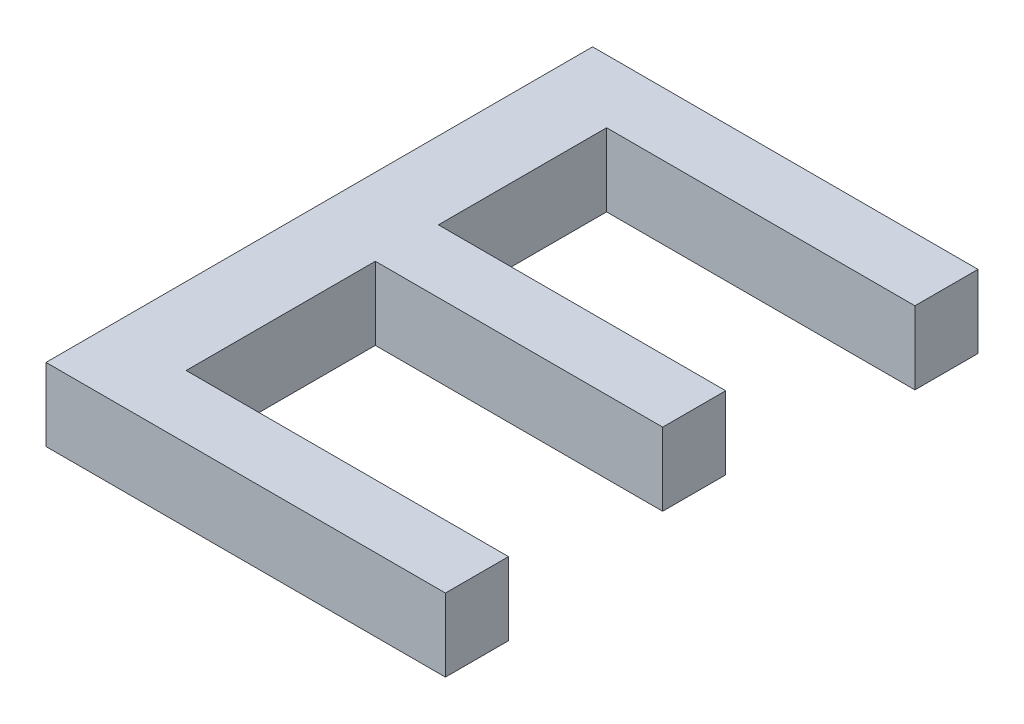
ISO-10303-21;
HEADER;
FILE_DESCRIPTION(('STEP AP214'),'2;1');
FILE_NAME('part.step','',(''),(''),'','','');
FILE_SCHEMA(('AUTOMOTIVE_DESIGN { 1 0 10303 214 1 1 1 1 }'));
ENDSEC;
DATA;
#1=APPLICATION_CONTEXT('core data for automotive mechanical design processes');
#2=APPLICATION_PROTOCOL_DEFINITION('international standard','automotive_design',2000,#1);
#3=PRODUCT_CONTEXT('',#1,'mechanical');
#4=PRODUCT('Part','Part','',(#3));
#5=PRODUCT_RELATED_PRODUCT_CATEGORY('part','',(#4));
#6=PRODUCT_DEFINITION_FORMATION('','',#4);
#7=PRODUCT_DEFINITION_CONTEXT('part definition',#1,'design');
#8=PRODUCT_DEFINITION('design','',#6,#7);
#9=PRODUCT_DEFINITION_SHAPE('','',#8);
#10=(LENGTH_UNIT() NAMED_UNIT(*) SI_UNIT(.MILLI.,.METRE.));
#11=(NAMED_UNIT(*) PLANE_ANGLE_UNIT() SI_UNIT($,.RADIAN.));
#12=(NAMED_UNIT(*) SI_UNIT($,.STERADIAN.) SOLID_ANGLE_UNIT());
#13=UNCERTAINTY_MEASURE_WITH_UNIT(LENGTH_MEASURE(1.E-05),#10,'distance_accuracy_value','');
#14=(GEOMETRIC_REPRESENTATION_CONTEXT(3) GLOBAL_UNCERTAINTY_ASSIGNED_CONTEXT((#13)) GLOBAL_UNIT_ASSIGNED_CONTEXT((#10,
#11,#12)) REPRESENTATION_CONTEXT('',''));
#15=CARTESIAN_POINT('',(0.,0.,0.));
#16=DIRECTION('',(0.,0.,1.));
#17=DIRECTION('',(1.,0.,0.));
#18=AXIS2_PLACEMENT_3D('',#15,#16,#17);
#19=CARTESIAN_POINT('',(0.,6.40004762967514,0.));
#20=DIRECTION('',(0.,-1.,0.));
#21=DIRECTION('',(-1.,0.,0.));
#22=AXIS2_PLACEMENT_3D('',#19,#20,#21);
#23=PLANE('',#22);
#24=DIRECTION('',(-1.,0.,0.));
#25=VECTOR('',#24,1.);
#26=CARTESIAN_POINT('',(0.,6.40004762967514,-8.93024100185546));
#27=LINE('',#26,#25);
#28=CARTESIAN_POINT('',(5.75738303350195,6.40004762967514,-8.93024100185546));
#29=VERTEX_POINT('',#28);
#30=CARTESIAN_POINT('',(4.6612291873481,6.40004762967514,-8.93024100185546));
#31=VERTEX_POINT('',#30);
#32=EDGE_CURVE('E170',#29,#31,#27,.T.);
#33=ORIENTED_EDGE('',*,*,#32,.T.);
#34=DIRECTION('',(0.,0.,-1.));
#35=VECTOR('',#34,1.);
#36=CARTESIAN_POINT('',(4.6612291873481,6.40004762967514,0.));
#37=LINE('',#36,#35);
#38=CARTESIAN_POINT('',(4.6612291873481,6.40004762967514,-10.4302410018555));
#39=VERTEX_POINT('',#38);
#40=EDGE_CURVE('E24',#31,#39,#37,.T.);
#41=ORIENTED_EDGE('',*,*,#40,.T.);
#42=DIRECTION('',(1.,0.,0.));
#43=VECTOR('',#42,1.);
#44=CARTESIAN_POINT('',(0.,6.40004762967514,-10.4302410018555));
#45=LINE('',#44,#43);
#46=CARTESIAN_POINT('',(5.71892149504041,6.40004762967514,-10.4302410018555));
#47=VERTEX_POINT('',#46);
#48=EDGE_CURVE('E231',#39,#47,#45,.T.);
#49=ORIENTED_EDGE('',*,*,#48,.T.);
#50=DIRECTION('',(0.,0.,1.));
#51=VECTOR('',#50,1.);
#52=CARTESIAN_POINT('',(5.71892149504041,6.40004762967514,0.));
#53=LINE('',#52,#51);
#54=CARTESIAN_POINT('',(5.71892149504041,6.40004762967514,-10.2571640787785));
#55=VERTEX_POINT('',#54);
#56=EDGE_CURVE('E240',#47,#55,#53,.T.);
#57=ORIENTED_EDGE('',*,*,#56,.T.);
#58=DIRECTION('',(-1.,0.,0.));
#59=VECTOR('',#58,1.);
#60=CARTESIAN_POINT('',(0.,6.40004762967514,-10.2571640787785));
#61=LINE('',#60,#59);
#62=CARTESIAN_POINT('',(4.87276764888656,6.40004762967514,-10.2571640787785));
#63=VERTEX_POINT('',#62);
#64=EDGE_CURVE('E247',#55,#63,#61,.T.);
#65=ORIENTED_EDGE('',*,*,#64,.T.);
#66=DIRECTION('',(0.,0.,1.));
#67=VECTOR('',#66,1.);
#68=CARTESIAN_POINT('',(4.87276764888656,6.40004762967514,0.));
#69=LINE('',#68,#67);
#70=CARTESIAN_POINT('',(4.87276764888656,6.40004762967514,-9.79562561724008));
#71=VERTEX_POINT('',#70);
#72=EDGE_CURVE('E193',#63,#71,#69,.T.);
#73=ORIENTED_EDGE('',*,*,#72,.T.);
#74=DIRECTION('',(1.,0.,0.));
#75=VECTOR('',#74,1.);
#76=CARTESIAN_POINT('',(0.,6.40004762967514,-9.79562561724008));
#77=LINE('',#76,#75);
#78=CARTESIAN_POINT('',(5.6612291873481,6.40004762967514,-9.79562561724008));
#79=VERTEX_POINT('',#78);
#80=EDGE_CURVE('E224',#71,#79,#77,.T.);
#81=ORIENTED_EDGE('',*,*,#80,.T.);
#82=DIRECTION('',(0.,0.,1.));
#83=VECTOR('',#82,1.);
#84=CARTESIAN_POINT('',(5.6612291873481,6.40004762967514,0.));
#85=LINE('',#84,#83);
#86=CARTESIAN_POINT('',(5.6612291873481,6.40004762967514,-9.62254869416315));
#87=VERTEX_POINT('',#86);
#88=EDGE_CURVE('E144',#79,#87,#85,.T.);
#89=ORIENTED_EDGE('',*,*,#88,.T.);
#90=DIRECTION('',(-1.,0.,0.));
#91=VECTOR('',#90,1.);
#92=CARTESIAN_POINT('',(0.,6.40004762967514,-9.62254869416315));
#93=LINE('',#92,#91);
#94=CARTESIAN_POINT('',(4.87276764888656,6.40004762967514,-9.62254869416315));
#95=VERTEX_POINT('',#94);
#96=EDGE_CURVE('E156',#87,#95,#93,.T.);
#97=ORIENTED_EDGE('',*,*,#96,.T.);
#98=DIRECTION('',(0.,0.,1.));
#99=VECTOR('',#98,1.);
#100=CARTESIAN_POINT('',(4.87276764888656,6.40004762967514,0.));
#101=LINE('',#100,#99);
#102=CARTESIAN_POINT('',(4.87276764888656,6.40004762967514,-9.10331792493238));
#103=VERTEX_POINT('',#102);
#104=EDGE_CURVE('E159',#95,#103,#101,.T.);
#105=ORIENTED_EDGE('',*,*,#104,.T.);
#106=DIRECTION('',(1.,0.,0.));
#107=VECTOR('',#106,1.);
#108=CARTESIAN_POINT('',(0.,6.40004762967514,-9.10331792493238));
#109=LINE('',#108,#107);
#110=CARTESIAN_POINT('',(5.75738303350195,6.40004762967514,-9.10331792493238));
#111=VERTEX_POINT('',#110);
#112=EDGE_CURVE('E207',#103,#111,#109,.T.);
#113=ORIENTED_EDGE('',*,*,#112,.T.);
#114=DIRECTION('',(0.,0.,1.));
#115=VECTOR('',#114,1.);
#116=CARTESIAN_POINT('',(5.75738303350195,6.40004762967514,0.));
#117=LINE('',#116,#115);
#118=EDGE_CURVE('E197',#111,#29,#117,.T.);
#119=ORIENTED_EDGE('',*,*,#118,.T.);
#120=EDGE_LOOP('',(#33,#41,#49,#57,#65,#73,#81,#89,#97,#105,#113,#119));
#121=FACE_BOUND('',#120,.T.);
#122=ADVANCED_FACE('F16',(#121),#23,.T.);
#123=CARTESIAN_POINT('',(0.,6.60004762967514,0.));
#124=DIRECTION('',(0.,-1.,0.));
#125=DIRECTION('',(-1.,0.,0.));
#126=AXIS2_PLACEMENT_3D('',#123,#124,#125);
#127=PLANE('',#126);
#128=DIRECTION('',(-1.,0.,0.));
#129=VECTOR('',#128,1.);
#130=CARTESIAN_POINT('',(0.,6.60004762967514,-8.93024100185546));
#131=LINE('',#130,#129);
#132=CARTESIAN_POINT('',(5.75738303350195,6.60004762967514,-8.93024100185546));
#133=VERTEX_POINT('',#132);
#134=CARTESIAN_POINT('',(4.6612291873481,6.60004762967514,-8.93024100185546));
#135=VERTEX_POINT('',#134);
#136=EDGE_CURVE('E176',#133,#135,#131,.T.);
#137=ORIENTED_EDGE('',*,*,#136,.F.);
#138=DIRECTION('',(0.,0.,1.));
#139=VECTOR('',#138,1.);
#140=CARTESIAN_POINT('',(5.75738303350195,6.60004762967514,0.));
#141=LINE('',#140,#139);
#142=CARTESIAN_POINT('',(5.75738303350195,6.60004762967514,-9.10331792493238));
#143=VERTEX_POINT('',#142);
#144=EDGE_CURVE('E204',#143,#133,#141,.T.);
#145=ORIENTED_EDGE('',*,*,#144,.F.);
#146=DIRECTION('',(1.,0.,0.));
#147=VECTOR('',#146,1.);
#148=CARTESIAN_POINT('',(0.,6.60004762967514,-9.10331792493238));
#149=LINE('',#148,#147);
#150=CARTESIAN_POINT('',(4.87276764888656,6.60004762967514,-9.10331792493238));
#151=VERTEX_POINT('',#150);
#152=EDGE_CURVE('E151',#151,#143,#149,.T.);
#153=ORIENTED_EDGE('',*,*,#152,.F.);
#154=DIRECTION('',(0.,0.,1.));
#155=VECTOR('',#154,1.);
#156=CARTESIAN_POINT('',(4.87276764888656,6.60004762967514,0.));
#157=LINE('',#156,#155);
#158=CARTESIAN_POINT('',(4.87276764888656,6.60004762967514,-9.62254869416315));
#159=VERTEX_POINT('',#158);
#160=EDGE_CURVE('E147',#159,#151,#157,.T.);
#161=ORIENTED_EDGE('',*,*,#160,.F.);
#162=DIRECTION('',(-1.,0.,0.));
#163=VECTOR('',#162,1.);
#164=CARTESIAN_POINT('',(0.,6.60004762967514,-9.62254869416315));
#165=LINE('',#164,#163);
#166=CARTESIAN_POINT('',(5.6612291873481,6.60004762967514,-9.62254869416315));
#167=VERTEX_POINT('',#166);
#168=EDGE_CURVE('E132',#167,#159,#165,.T.);
#169=ORIENTED_EDGE('',*,*,#168,.F.);
#170=DIRECTION('',(0.,0.,1.));
#171=VECTOR('',#170,1.);
#172=CARTESIAN_POINT('',(5.6612291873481,6.60004762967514,0.));
#173=LINE('',#172,#171);
#174=CARTESIAN_POINT('',(5.6612291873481,6.60004762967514,-9.79562561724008));
#175=VERTEX_POINT('',#174);
#176=EDGE_CURVE('E221',#175,#167,#173,.T.);
#177=ORIENTED_EDGE('',*,*,#176,.F.);
#178=DIRECTION('',(1.,0.,0.));
#179=VECTOR('',#178,1.);
#180=CARTESIAN_POINT('',(0.,6.60004762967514,-9.79562561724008));
#181=LINE('',#180,#179);
#182=CARTESIAN_POINT('',(4.87276764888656,6.60004762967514,-9.79562561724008));
#183=VERTEX_POINT('',#182);
#184=EDGE_CURVE('E236',#183,#175,#181,.T.);
#185=ORIENTED_EDGE('',*,*,#184,.F.);
#186=DIRECTION('',(0.,0.,1.));
#187=VECTOR('',#186,1.);
#188=CARTESIAN_POINT('',(4.87276764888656,6.60004762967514,0.));
#189=LINE('',#188,#187);
#190=CARTESIAN_POINT('',(4.87276764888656,6.60004762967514,-10.2571640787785));
#191=VERTEX_POINT('',#190);
#192=EDGE_CURVE('E192',#191,#183,#189,.T.);
#193=ORIENTED_EDGE('',*,*,#192,.F.);
#194=DIRECTION('',(-1.,0.,0.));
#195=VECTOR('',#194,1.);
#196=CARTESIAN_POINT('',(0.,6.60004762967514,-10.2571640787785));
#197=LINE('',#196,#195);
#198=CARTESIAN_POINT('',(5.71892149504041,6.60004762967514,-10.2571640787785));
#199=VERTEX_POINT('',#198);
#200=EDGE_CURVE('E250',#199,#191,#197,.T.);
#201=ORIENTED_EDGE('',*,*,#200,.F.);
#202=DIRECTION('',(0.,0.,1.));
#203=VECTOR('',#202,1.);
#204=CARTESIAN_POINT('',(5.71892149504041,6.60004762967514,0.));
#205=LINE('',#204,#203);
#206=CARTESIAN_POINT('',(5.71892149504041,6.60004762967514,-10.4302410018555));
#207=VERTEX_POINT('',#206);
#208=EDGE_CURVE('E228',#207,#199,#205,.T.);
#209=ORIENTED_EDGE('',*,*,#208,.F.);
#210=DIRECTION('',(1.,0.,0.));
#211=VECTOR('',#210,1.);
#212=CARTESIAN_POINT('',(0.,6.60004762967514,-10.4302410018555));
#213=LINE('',#212,#211);
#214=CARTESIAN_POINT('',(4.6612291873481,6.60004762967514,-10.4302410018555));
#215=VERTEX_POINT('',#214);
#216=EDGE_CURVE('E185',#215,#207,#213,.T.);
#217=ORIENTED_EDGE('',*,*,#216,.F.);
#218=DIRECTION('',(0.,0.,-1.));
#219=VECTOR('',#218,1.);
#220=CARTESIAN_POINT('',(4.6612291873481,6.60004762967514,0.));
#221=LINE('',#220,#219);
#222=EDGE_CURVE('E11',#135,#215,#221,.T.);
#223=ORIENTED_EDGE('',*,*,#222,.F.);
#224=EDGE_LOOP('',(#137,#145,#153,#161,#169,#177,#185,#193,#201,#209,#217,#223));
#225=FACE_BOUND('',#224,.T.);
#226=ADVANCED_FACE('F149',(#225),#127,.F.);
#227=CARTESIAN_POINT('',(4.6612291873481,6.60004762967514,0.));
#228=DIRECTION('',(-1.,0.,0.));
#229=DIRECTION('',(0.,0.,1.));
#230=AXIS2_PLACEMENT_3D('',#227,#228,#229);
#231=PLANE('',#230);
#232=ORIENTED_EDGE('',*,*,#40,.F.);
#233=DIRECTION('',(0.,-1.,0.));
#234=VECTOR('',#233,1.);
#235=CARTESIAN_POINT('',(4.6612291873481,6.60004762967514,-8.93024100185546));
#236=LINE('',#235,#234);
#237=EDGE_CURVE('E182',#135,#31,#236,.T.);
#238=ORIENTED_EDGE('',*,*,#237,.F.);
#239=ORIENTED_EDGE('',*,*,#222,.T.);
#240=DIRECTION('',(0.,-1.,0.));
#241=VECTOR('',#240,1.);
#242=CARTESIAN_POINT('',(4.6612291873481,6.60004762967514,-10.4302410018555));
#243=LINE('',#242,#241);
#244=EDGE_CURVE('E257',#215,#39,#243,.T.);
#245=ORIENTED_EDGE('',*,*,#244,.T.);
#246=EDGE_LOOP('',(#232,#238,#239,#245));
#247=FACE_BOUND('',#246,.T.);
#248=ADVANCED_FACE('F304',(#247),#231,.T.);
#249=CARTESIAN_POINT('',(0.,6.60004762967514,-10.4302410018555));
#250=DIRECTION('',(0.,0.,-1.));
#251=DIRECTION('',(0.,-1.,0.));
#252=AXIS2_PLACEMENT_3D('',#249,#250,#251);
#253=PLANE('',#252);
#254=ORIENTED_EDGE('',*,*,#48,.F.);
#255=ORIENTED_EDGE('',*,*,#244,.F.);
#256=ORIENTED_EDGE('',*,*,#216,.T.);
#257=DIRECTION('',(0.,-1.,0.));
#258=VECTOR('',#257,1.);
#259=CARTESIAN_POINT('',(5.71892149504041,6.60004762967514,-10.4302410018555));
#260=LINE('',#259,#258);
#261=EDGE_CURVE('E232',#207,#47,#260,.T.);
#262=ORIENTED_EDGE('',*,*,#261,.T.);
#263=EDGE_LOOP('',(#254,#255,#256,#262));
#264=FACE_BOUND('',#263,.T.);
#265=ADVANCED_FACE('F265',(#264),#253,.T.);
#266=CARTESIAN_POINT('',(5.71892149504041,6.60004762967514,0.));
#267=DIRECTION('',(1.,0.,0.));
#268=DIRECTION('',(0.,-1.,0.));
#269=AXIS2_PLACEMENT_3D('',#266,#267,#268);
#270=PLANE('',#269);
#271=ORIENTED_EDGE('',*,*,#56,.F.);
#272=ORIENTED_EDGE('',*,*,#261,.F.);
#273=ORIENTED_EDGE('',*,*,#208,.T.);
#274=DIRECTION('',(0.,-1.,0.));
#275=VECTOR('',#274,1.);
#276=CARTESIAN_POINT('',(5.71892149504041,6.60004762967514,-10.2571640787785));
#277=LINE('',#276,#275);
#278=EDGE_CURVE('E169',#199,#55,#277,.T.);
#279=ORIENTED_EDGE('',*,*,#278,.T.);
#280=EDGE_LOOP('',(#271,#272,#273,#279));
#281=FACE_BOUND('',#280,.T.);
#282=ADVANCED_FACE('F273',(#281),#270,.T.);
#283=CARTESIAN_POINT('',(0.,6.60004762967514,-10.2571640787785));
#284=DIRECTION('',(0.,0.,1.));
#285=DIRECTION('',(1.,0.,0.));
#286=AXIS2_PLACEMENT_3D('',#283,#284,#285);
#287=PLANE('',#286);
#288=ORIENTED_EDGE('',*,*,#64,.F.);
#289=ORIENTED_EDGE('',*,*,#278,.F.);
#290=ORIENTED_EDGE('',*,*,#200,.T.);
#291=DIRECTION('',(0.,-1.,0.));
#292=VECTOR('',#291,1.);
#293=CARTESIAN_POINT('',(4.87276764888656,6.60004762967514,-10.2571640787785));
#294=LINE('',#293,#292);
#295=EDGE_CURVE('E188',#191,#63,#294,.T.);
#296=ORIENTED_EDGE('',*,*,#295,.T.);
#297=EDGE_LOOP('',(#288,#289,#290,#296));
#298=FACE_BOUND('',#297,.T.);
#299=ADVANCED_FACE('F278',(#298),#287,.T.);
#300=CARTESIAN_POINT('',(4.87276764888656,6.60004762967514,0.));
#301=DIRECTION('',(1.,0.,0.));
#302=DIRECTION('',(0.,-1.,0.));
#303=AXIS2_PLACEMENT_3D('',#300,#301,#302);
#304=PLANE('',#303);
#305=ORIENTED_EDGE('',*,*,#72,.F.);
#306=ORIENTED_EDGE('',*,*,#295,.F.);
#307=ORIENTED_EDGE('',*,*,#192,.T.);
#308=DIRECTION('',(0.,-1.,0.));
#309=VECTOR('',#308,1.);
#310=CARTESIAN_POINT('',(4.87276764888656,6.60004762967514,-9.79562561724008));
#311=LINE('',#310,#309);
#312=EDGE_CURVE('E227',#183,#71,#311,.T.);
#313=ORIENTED_EDGE('',*,*,#312,.T.);
#314=EDGE_LOOP('',(#305,#306,#307,#313));
#315=FACE_BOUND('',#314,.T.);
#316=ADVANCED_FACE('F280',(#315),#304,.T.);
#317=CARTESIAN_POINT('',(0.,6.60004762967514,-9.79562561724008));
#318=DIRECTION('',(0.,0.,-1.));
#319=DIRECTION('',(0.,-1.,0.));
#320=AXIS2_PLACEMENT_3D('',#317,#318,#319);
#321=PLANE('',#320);
#322=ORIENTED_EDGE('',*,*,#80,.F.);
#323=ORIENTED_EDGE('',*,*,#312,.F.);
#324=ORIENTED_EDGE('',*,*,#184,.T.);
#325=DIRECTION('',(0.,-1.,0.));
#326=VECTOR('',#325,1.);
#327=CARTESIAN_POINT('',(5.6612291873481,6.60004762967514,-9.79562561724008));
#328=LINE('',#327,#326);
#329=EDGE_CURVE('E217',#175,#79,#328,.T.);
#330=ORIENTED_EDGE('',*,*,#329,.T.);
#331=EDGE_LOOP('',(#322,#323,#324,#330));
#332=FACE_BOUND('',#331,.T.);
#333=ADVANCED_FACE('F285',(#332),#321,.T.);
#334=CARTESIAN_POINT('',(5.6612291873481,6.60004762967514,0.));
#335=DIRECTION('',(1.,0.,0.));
#336=DIRECTION('',(0.,-1.,0.));
#337=AXIS2_PLACEMENT_3D('',#334,#335,#336);
#338=PLANE('',#337);
#339=ORIENTED_EDGE('',*,*,#88,.F.);
#340=ORIENTED_EDGE('',*,*,#329,.F.);
#341=ORIENTED_EDGE('',*,*,#176,.T.);
#342=DIRECTION('',(0.,-1.,0.));
#343=VECTOR('',#342,1.);
#344=CARTESIAN_POINT('',(5.6612291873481,6.60004762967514,-9.62254869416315));
#345=LINE('',#344,#343);
#346=EDGE_CURVE('E140',#167,#87,#345,.T.);
#347=ORIENTED_EDGE('',*,*,#346,.T.);
#348=EDGE_LOOP('',(#339,#340,#341,#347));
#349=FACE_BOUND('',#348,.T.);
#350=ADVANCED_FACE('F289',(#349),#338,.T.);
#351=CARTESIAN_POINT('',(0.,6.60004762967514,-9.62254869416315));
#352=DIRECTION('',(0.,0.,1.));
#353=DIRECTION('',(1.,0.,0.));
#354=AXIS2_PLACEMENT_3D('',#351,#352,#353);
#355=PLANE('',#354);
#356=ORIENTED_EDGE('',*,*,#96,.F.);
#357=ORIENTED_EDGE('',*,*,#346,.F.);
#358=ORIENTED_EDGE('',*,*,#168,.T.);
#359=DIRECTION('',(0.,-1.,0.));
#360=VECTOR('',#359,1.);
#361=CARTESIAN_POINT('',(4.87276764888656,6.60004762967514,-9.62254869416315));
#362=LINE('',#361,#360);
#363=EDGE_CURVE('E137',#159,#95,#362,.T.);
#364=ORIENTED_EDGE('',*,*,#363,.T.);
#365=EDGE_LOOP('',(#356,#357,#358,#364));
#366=FACE_BOUND('',#365,.T.);
#367=ADVANCED_FACE('F135',(#366),#355,.T.);
#368=CARTESIAN_POINT('',(4.87276764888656,6.60004762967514,0.));
#369=DIRECTION('',(1.,0.,0.));
#370=DIRECTION('',(0.,-1.,0.));
#371=AXIS2_PLACEMENT_3D('',#368,#369,#370);
#372=PLANE('',#371);
#373=ORIENTED_EDGE('',*,*,#104,.F.);
#374=ORIENTED_EDGE('',*,*,#363,.F.);
#375=ORIENTED_EDGE('',*,*,#160,.T.);
#376=DIRECTION('',(0.,-1.,0.));
#377=VECTOR('',#376,1.);
#378=CARTESIAN_POINT('',(4.87276764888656,6.60004762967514,-9.10331792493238));
#379=LINE('',#378,#377);
#380=EDGE_CURVE('E210',#151,#103,#379,.T.);
#381=ORIENTED_EDGE('',*,*,#380,.T.);
#382=EDGE_LOOP('',(#373,#374,#375,#381));
#383=FACE_BOUND('',#382,.T.);
#384=ADVANCED_FACE('F158',(#383),#372,.T.);
#385=CARTESIAN_POINT('',(0.,6.60004762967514,-9.10331792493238));
#386=DIRECTION('',(0.,0.,-1.));
#387=DIRECTION('',(0.,-1.,0.));
#388=AXIS2_PLACEMENT_3D('',#385,#386,#387);
#389=PLANE('',#388);
#390=ORIENTED_EDGE('',*,*,#112,.F.);
#391=ORIENTED_EDGE('',*,*,#380,.F.);
#392=ORIENTED_EDGE('',*,*,#152,.T.);
#393=DIRECTION('',(0.,-1.,0.));
#394=VECTOR('',#393,1.);
#395=CARTESIAN_POINT('',(5.75738303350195,6.60004762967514,-9.10331792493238));
#396=LINE('',#395,#394);
#397=EDGE_CURVE('E200',#143,#111,#396,.T.);
#398=ORIENTED_EDGE('',*,*,#397,.T.);
#399=EDGE_LOOP('',(#390,#391,#392,#398));
#400=FACE_BOUND('',#399,.T.);
#401=ADVANCED_FACE('F328',(#400),#389,.T.);
#402=CARTESIAN_POINT('',(5.75738303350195,6.60004762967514,0.));
#403=DIRECTION('',(1.,0.,0.));
#404=DIRECTION('',(0.,-1.,0.));
#405=AXIS2_PLACEMENT_3D('',#402,#403,#404);
#406=PLANE('',#405);
#407=ORIENTED_EDGE('',*,*,#118,.F.);
#408=ORIENTED_EDGE('',*,*,#397,.F.);
#409=ORIENTED_EDGE('',*,*,#144,.T.);
#410=DIRECTION('',(0.,-1.,0.));
#411=VECTOR('',#410,1.);
#412=CARTESIAN_POINT('',(5.75738303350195,6.60004762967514,-8.93024100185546));
#413=LINE('',#412,#411);
#414=EDGE_CURVE('E172',#133,#29,#413,.T.);
#415=ORIENTED_EDGE('',*,*,#414,.T.);
#416=EDGE_LOOP('',(#407,#408,#409,#415));
#417=FACE_BOUND('',#416,.T.);
#418=ADVANCED_FACE('F323',(#417),#406,.T.);
#419=CARTESIAN_POINT('',(0.,6.60004762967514,-8.93024100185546));
#420=DIRECTION('',(0.,0.,1.));
#421=DIRECTION('',(1.,0.,0.));
#422=AXIS2_PLACEMENT_3D('',#419,#420,#421);
#423=PLANE('',#422);
#424=ORIENTED_EDGE('',*,*,#32,.F.);
#425=ORIENTED_EDGE('',*,*,#414,.F.);
#426=ORIENTED_EDGE('',*,*,#136,.T.);
#427=ORIENTED_EDGE('',*,*,#237,.T.);
#428=EDGE_LOOP('',(#424,#425,#426,#427));
#429=FACE_BOUND('',#428,.T.);
#430=ADVANCED_FACE('F321',(#429),#423,.T.);
#431=CLOSED_SHELL('',(#122,#226,#248,#265,#282,#299,#316,#333,#350,#367,#384,#401,#418,#430));
#432=MANIFOLD_SOLID_BREP('B1',#431);
#433=ADVANCED_BREP_SHAPE_REPRESENTATION('',(#18,#432),#14);
#434=SHAPE_DEFINITION_REPRESENTATION(#9,#433);
ENDSEC;
END-ISO-10303-21;
